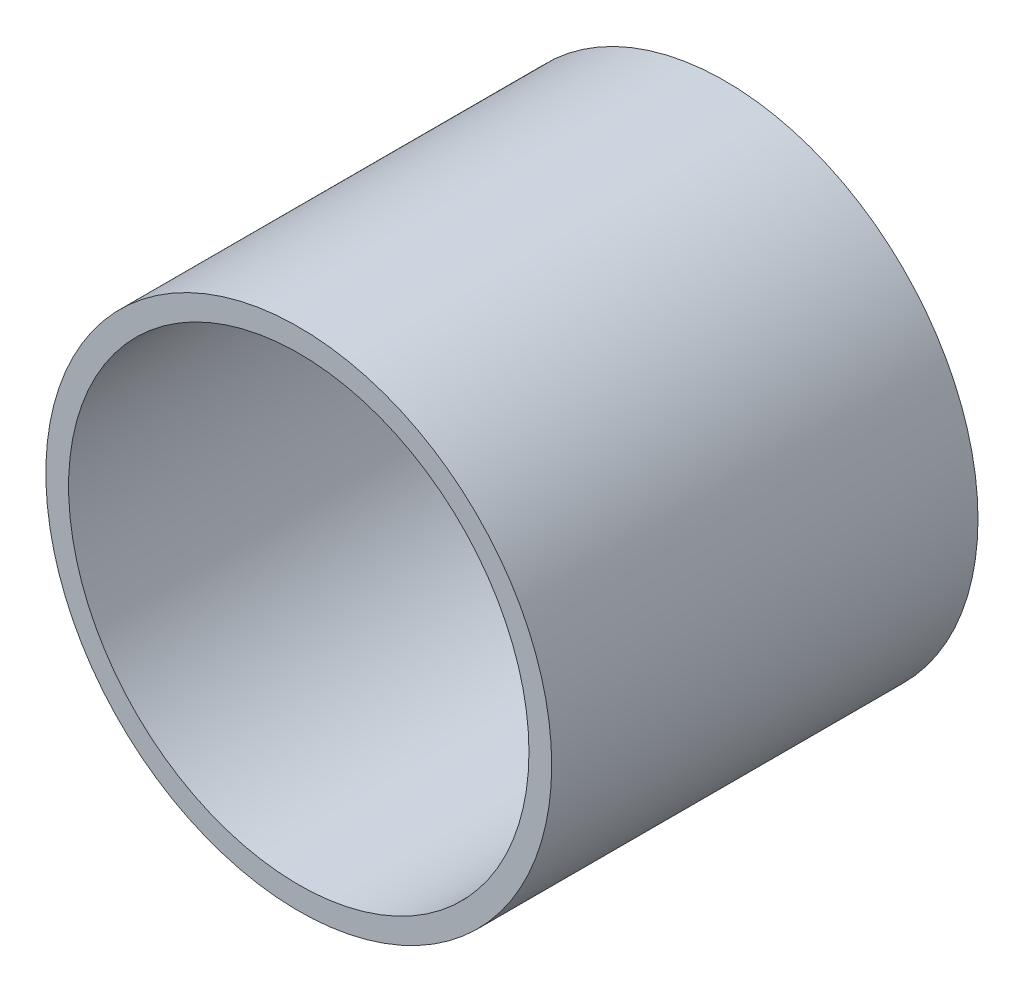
ISO-10303-21;
HEADER;
FILE_DESCRIPTION(('STEP AP214'),'2;1');
FILE_NAME('part.step','',(''),(''),'','','');
FILE_SCHEMA(('AUTOMOTIVE_DESIGN { 1 0 10303 214 1 1 1 1 }'));
ENDSEC;
DATA;
#1=APPLICATION_CONTEXT('core data for automotive mechanical design processes');
#2=APPLICATION_PROTOCOL_DEFINITION('international standard','automotive_design',2000,#1);
#3=PRODUCT_CONTEXT('',#1,'mechanical');
#4=PRODUCT('Part','Part','',(#3));
#5=PRODUCT_RELATED_PRODUCT_CATEGORY('part','',(#4));
#6=PRODUCT_DEFINITION_FORMATION('','',#4);
#7=PRODUCT_DEFINITION_CONTEXT('part definition',#1,'design');
#8=PRODUCT_DEFINITION('design','',#6,#7);
#9=PRODUCT_DEFINITION_SHAPE('','',#8);
#10=(LENGTH_UNIT() NAMED_UNIT(*) SI_UNIT(.MILLI.,.METRE.));
#11=(NAMED_UNIT(*) PLANE_ANGLE_UNIT() SI_UNIT($,.RADIAN.));
#12=(NAMED_UNIT(*) SI_UNIT($,.STERADIAN.) SOLID_ANGLE_UNIT());
#13=UNCERTAINTY_MEASURE_WITH_UNIT(LENGTH_MEASURE(1.E-05),#10,'distance_accuracy_value','');
#14=(GEOMETRIC_REPRESENTATION_CONTEXT(3) GLOBAL_UNCERTAINTY_ASSIGNED_CONTEXT((#13)) GLOBAL_UNIT_ASSIGNED_CONTEXT((#10,
#11,#12)) REPRESENTATION_CONTEXT('',''));
#15=CARTESIAN_POINT('',(0.,0.,0.));
#16=DIRECTION('',(0.,0.,1.));
#17=DIRECTION('',(1.,0.,0.));
#18=AXIS2_PLACEMENT_3D('',#15,#16,#17);
#19=CARTESIAN_POINT('',(0.,0.,15.));
#20=DIRECTION('',(0.,0.,1.));
#21=DIRECTION('',(1.,0.,0.));
#22=AXIS2_PLACEMENT_3D('',#19,#20,#21);
#23=PLANE('',#22);
#24=CARTESIAN_POINT('',(0.,0.,15.));
#25=DIRECTION('',(0.,0.,1.));
#26=DIRECTION('',(1.,0.,0.));
#27=AXIS2_PLACEMENT_3D('',#24,#25,#26);
#28=CIRCLE('',#27,8.9);
#29=CARTESIAN_POINT('',(8.9,0.,15.));
#30=VERTEX_POINT('',#29);
#31=EDGE_CURVE('E10',#30,#30,#28,.T.);
#32=ORIENTED_EDGE('',*,*,#31,.T.);
#33=EDGE_LOOP('',(#32));
#34=FACE_BOUND('',#33,.T.);
#35=CARTESIAN_POINT('',(0.,0.,15.));
#36=DIRECTION('',(0.,0.,1.));
#37=DIRECTION('',(1.,0.,0.));
#38=AXIS2_PLACEMENT_3D('',#35,#36,#37);
#39=CIRCLE('',#38,8.1);
#40=CARTESIAN_POINT('',(8.1,0.,15.));
#41=VERTEX_POINT('',#40);
#42=EDGE_CURVE('E37',#41,#41,#39,.T.);
#43=ORIENTED_EDGE('',*,*,#42,.F.);
#44=EDGE_LOOP('',(#43));
#45=FACE_BOUND('',#44,.T.);
#46=ADVANCED_FACE('F26',(#34,#45),#23,.T.);
#47=CARTESIAN_POINT('',(0.,0.,0.));
#48=DIRECTION('',(0.,0.,1.));
#49=DIRECTION('',(1.,0.,0.));
#50=AXIS2_PLACEMENT_3D('',#47,#48,#49);
#51=PLANE('',#50);
#52=CARTESIAN_POINT('',(0.,0.,0.));
#53=DIRECTION('',(0.,0.,1.));
#54=DIRECTION('',(1.,0.,0.));
#55=AXIS2_PLACEMENT_3D('',#52,#53,#54);
#56=CIRCLE('',#55,8.9);
#57=CARTESIAN_POINT('',(8.9,0.,0.));
#58=VERTEX_POINT('',#57);
#59=EDGE_CURVE('E33',#58,#58,#56,.T.);
#60=ORIENTED_EDGE('',*,*,#59,.F.);
#61=EDGE_LOOP('',(#60));
#62=FACE_BOUND('',#61,.T.);
#63=CARTESIAN_POINT('',(0.,0.,0.));
#64=DIRECTION('',(0.,0.,1.));
#65=DIRECTION('',(1.,0.,0.));
#66=AXIS2_PLACEMENT_3D('',#63,#64,#65);
#67=CIRCLE('',#66,8.1);
#68=CARTESIAN_POINT('',(8.1,0.,0.));
#69=VERTEX_POINT('',#68);
#70=EDGE_CURVE('E41',#69,#69,#67,.T.);
#71=ORIENTED_EDGE('',*,*,#70,.T.);
#72=EDGE_LOOP('',(#71));
#73=FACE_BOUND('',#72,.T.);
#74=ADVANCED_FACE('F47',(#62,#73),#51,.F.);
#75=CARTESIAN_POINT('',(0.,0.,15.));
#76=DIRECTION('',(0.,0.,-1.));
#77=DIRECTION('',(-1.,0.,0.));
#78=AXIS2_PLACEMENT_3D('',#75,#76,#77);
#79=CYLINDRICAL_SURFACE('',#78,8.9);
#80=ORIENTED_EDGE('',*,*,#31,.F.);
#81=EDGE_LOOP('',(#80));
#82=FACE_BOUND('',#81,.T.);
#83=ORIENTED_EDGE('',*,*,#59,.T.);
#84=EDGE_LOOP('',(#83));
#85=FACE_BOUND('',#84,.T.);
#86=ADVANCED_FACE('F28',(#82,#85),#79,.T.);
#87=CARTESIAN_POINT('',(0.,0.,15.));
#88=DIRECTION('',(0.,0.,-1.));
#89=DIRECTION('',(-1.,0.,0.));
#90=AXIS2_PLACEMENT_3D('',#87,#88,#89);
#91=CYLINDRICAL_SURFACE('',#90,8.1);
#92=ORIENTED_EDGE('',*,*,#42,.T.);
#93=EDGE_LOOP('',(#92));
#94=FACE_BOUND('',#93,.T.);
#95=ORIENTED_EDGE('',*,*,#70,.F.);
#96=EDGE_LOOP('',(#95));
#97=FACE_BOUND('',#96,.T.);
#98=ADVANCED_FACE('F49',(#94,#97),#91,.F.);
#99=CLOSED_SHELL('',(#46,#74,#86,#98));
#100=MANIFOLD_SOLID_BREP('B2',#99);
#101=ADVANCED_BREP_SHAPE_REPRESENTATION('',(#18,#100),#14);
#102=SHAPE_DEFINITION_REPRESENTATION(#9,#101);
ENDSEC;
END-ISO-10303-21;
